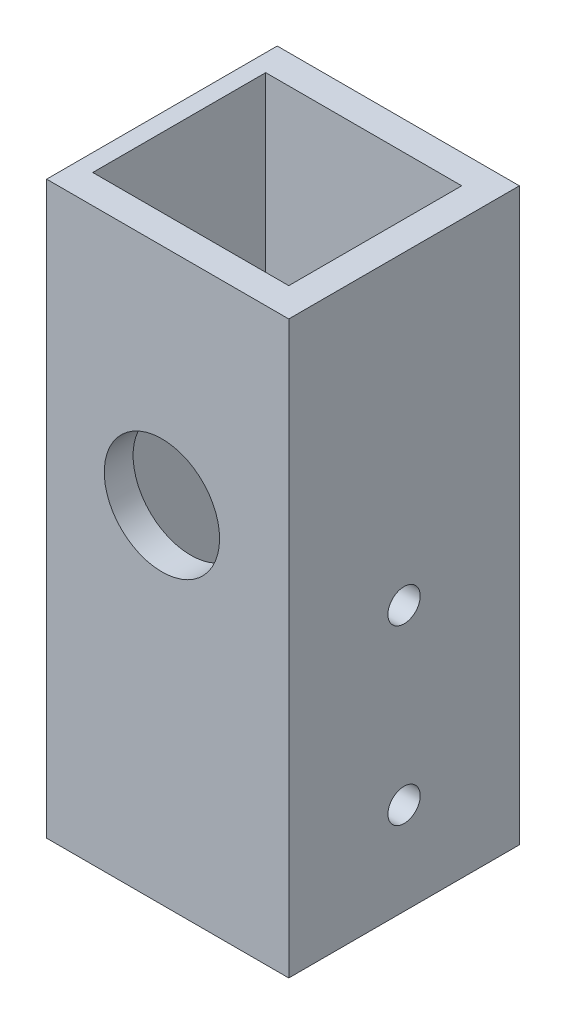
from build123d import *

# Parameters (mm, degrees)
SKETCH2_W           = 15
SKETCH2_H           = 30
BOSS_EXTRUDE1_DEPTH = 3.5
SKETCH4_W           = 16.5
SKETCH4_H           = 30
BOSS_EXTRUDE2_DEPTH = 3.5
SKETCH6_W           = 16.5
SKETCH6_H           = 30
BOSS_EXTRUDE4_DEPTH = 3.5
SKETCH7_W           = 22
SKETCH7_H           = 30
BOSS_EXTRUDE5_DEPTH = 3.5
SKETCH8_W           = 22
SKETCH8_H           = 20
SKETCH8_W_2         = 15
SKETCH8_H_2         = 13
BOSS_EXTRUDE6_DEPTH = 12
SKETCH9_R           = 1.4
CUT_EXTRUDE1_DEPTH  = 5
SKETCH11_W          = 17
SKETCH11_H          = 15
CUT_EXTRUDE2_DEPTH  = 50
SKETCH12_R          = 5
CUT_EXTRUDE3_DEPTH  = 10
SKETCH13_W          = 22
SKETCH13_H          = 20
SKETCH13_W_2        = 17
SKETCH13_H_2        = 15
BOSS_EXTRUDE7_DEPTH = 7.5
SKETCH14_W          = 1
SKETCH14_H          = 20
CUT_EXTRUDE4_DEPTH  = 50


with BuildPart() as part:
    # Sketch2 → Boss-Extrude1 (new body)
    with BuildSketch(Plane.XY):
        with Locations((0, -15)):
            Rectangle(SKETCH2_W, SKETCH2_H)
    extrude(amount=BOSS_EXTRUDE1_DEPTH)

    # Sketch4 → Boss-Extrude2 (add)
    with BuildSketch(Plane(origin=(7.5, 0, 0), x_dir=(0, 0, -1), z_dir=(1, 0, 0))):
        with Locations((4.75, -15)):
            Rectangle(SKETCH4_W, SKETCH4_H)
    extrude(amount=BOSS_EXTRUDE2_DEPTH)

    # Sketch6 → Boss-Extrude4 (add)
    with BuildSketch(Plane.ZY.offset(7.5)):
        with Locations((-4.75, -15)):
            Rectangle(SKETCH6_W, SKETCH6_H)
    extrude(amount=BOSS_EXTRUDE4_DEPTH)

    # Sketch7 → Boss-Extrude5 (add)
    with BuildSketch(Plane(origin=(0, 0, -13), x_dir=(-1, 0, 0), z_dir=(0, 0, -1))):
        with Locations((0, -15)):
            Rectangle(SKETCH7_W, SKETCH7_H)
    extrude(amount=BOSS_EXTRUDE5_DEPTH)

    # Sketch8 → Boss-Extrude6 (add)
    with BuildSketch(Plane(origin=(0, 0, 0), x_dir=(1, 0, 0), z_dir=(0, 1, 0))):
        with Locations((0, 6.5)):
            Rectangle(SKETCH8_W, SKETCH8_H)
        with Locations((0, 6.5)):
            Rectangle(SKETCH8_W_2, SKETCH8_H_2, mode=Mode.SUBTRACT)
    extrude(amount=BOSS_EXTRUDE6_DEPTH)

    # Sketch9 → Cut-Extrude1 (cut)
    with BuildSketch(Plane(origin=(11, 0, 0), x_dir=(0, 0, -1), z_dir=(1, 0, 0))):
        with Locations((6.5, -22)):
            Circle(SKETCH9_R)
        with Locations((6.5, -7)):
            Circle(SKETCH9_R)
    extrude(amount=-CUT_EXTRUDE1_DEPTH, mode=Mode.SUBTRACT)

    # Sketch11 → Cut-Extrude2 (cut)
    with BuildSketch(Plane.XZ.offset(30)):
        with Locations((0, -6.5)):
            Rectangle(SKETCH11_W, SKETCH11_H)
    extrude(amount=-CUT_EXTRUDE2_DEPTH, mode=Mode.SUBTRACT)

    # Sketch12 → Cut-Extrude3 (cut)
    with BuildSketch(Plane.XY.offset(3.5)):
        Circle(SKETCH12_R)
    extrude(amount=-CUT_EXTRUDE3_DEPTH, mode=Mode.SUBTRACT)

    # Sketch13 → Boss-Extrude7 (add)
    with BuildSketch(Plane(origin=(0, 12, 0), x_dir=(1, 0, 0), z_dir=(0, 1, 0))):
        with Locations((0, 6.5)):
            Rectangle(SKETCH13_W, SKETCH13_H)
        with Locations((0, 6.5)):
            Rectangle(SKETCH13_W_2, SKETCH13_H_2, mode=Mode.SUBTRACT)
    extrude(amount=BOSS_EXTRUDE7_DEPTH)

    # Sketch14 → Cut-Extrude4 (cut)
    with BuildSketch(Plane(origin=(0, 19.5, 0), x_dir=(1, 0, 0), z_dir=(0, 1, 0))):
        with Locations((-10.5, 6.5)):
            Rectangle(SKETCH14_W, SKETCH14_H)
    extrude(amount=-CUT_EXTRUDE4_DEPTH, mode=Mode.SUBTRACT)


solid = part.part
